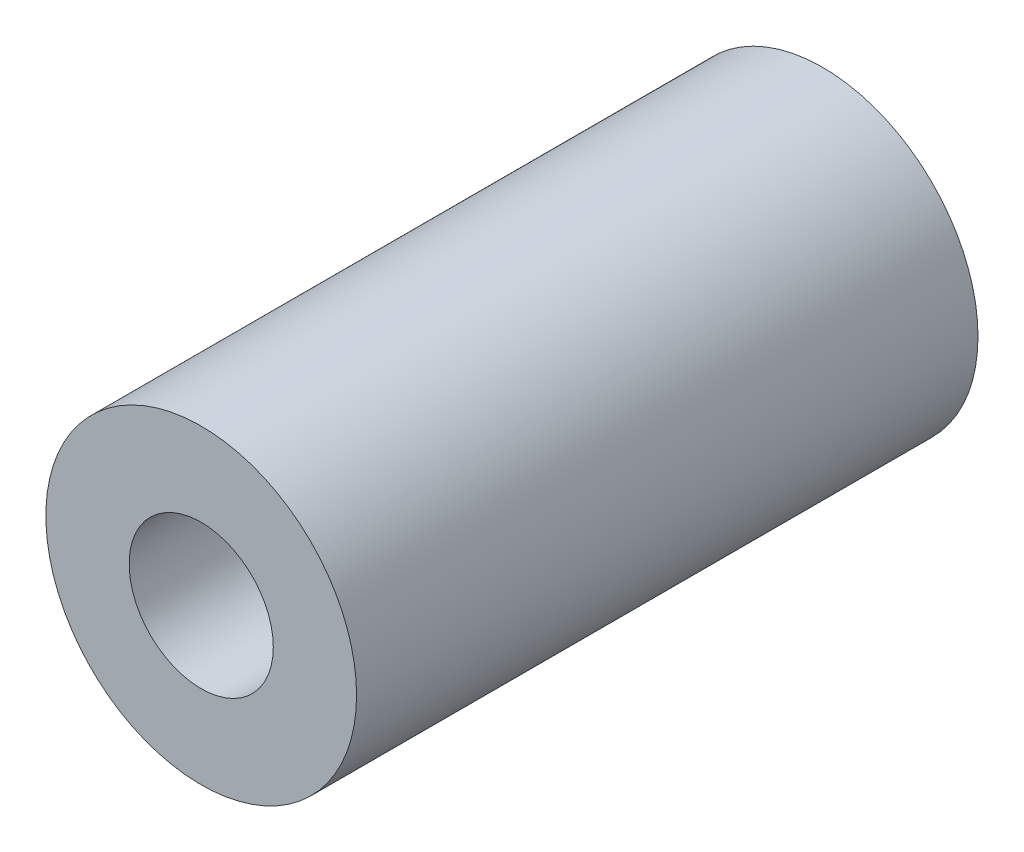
ISO-10303-21;
HEADER;
FILE_DESCRIPTION(('STEP AP214'),'2;1');
FILE_NAME('part.step','',(''),(''),'','','');
FILE_SCHEMA(('AUTOMOTIVE_DESIGN { 1 0 10303 214 1 1 1 1 }'));
ENDSEC;
DATA;
#1=APPLICATION_CONTEXT('core data for automotive mechanical design processes');
#2=APPLICATION_PROTOCOL_DEFINITION('international standard','automotive_design',2000,#1);
#3=PRODUCT_CONTEXT('',#1,'mechanical');
#4=PRODUCT('Part','Part','',(#3));
#5=PRODUCT_RELATED_PRODUCT_CATEGORY('part','',(#4));
#6=PRODUCT_DEFINITION_FORMATION('','',#4);
#7=PRODUCT_DEFINITION_CONTEXT('part definition',#1,'design');
#8=PRODUCT_DEFINITION('design','',#6,#7);
#9=PRODUCT_DEFINITION_SHAPE('','',#8);
#10=(LENGTH_UNIT() NAMED_UNIT(*) SI_UNIT(.MILLI.,.METRE.));
#11=(NAMED_UNIT(*) PLANE_ANGLE_UNIT() SI_UNIT($,.RADIAN.));
#12=(NAMED_UNIT(*) SI_UNIT($,.STERADIAN.) SOLID_ANGLE_UNIT());
#13=UNCERTAINTY_MEASURE_WITH_UNIT(LENGTH_MEASURE(1.E-05),#10,'distance_accuracy_value','');
#14=(GEOMETRIC_REPRESENTATION_CONTEXT(3) GLOBAL_UNCERTAINTY_ASSIGNED_CONTEXT((#13)) GLOBAL_UNIT_ASSIGNED_CONTEXT((#10,
#11,#12)) REPRESENTATION_CONTEXT('',''));
#15=CARTESIAN_POINT('',(0.,0.,0.));
#16=DIRECTION('',(0.,0.,1.));
#17=DIRECTION('',(1.,0.,0.));
#18=AXIS2_PLACEMENT_3D('',#15,#16,#17);
#19=CARTESIAN_POINT('',(0.,0.,12.7));
#20=DIRECTION('',(0.,0.,-1.));
#21=DIRECTION('',(-1.,0.,0.));
#22=AXIS2_PLACEMENT_3D('',#19,#20,#21);
#23=CYLINDRICAL_SURFACE('',#22,3.175);
#24=CARTESIAN_POINT('',(0.,0.,12.7));
#25=DIRECTION('',(0.,0.,1.));
#26=DIRECTION('',(1.,0.,0.));
#27=AXIS2_PLACEMENT_3D('',#24,#25,#26);
#28=CIRCLE('',#27,3.175);
#29=CARTESIAN_POINT('',(3.175,0.,12.7));
#30=VERTEX_POINT('',#29);
#31=EDGE_CURVE('E10',#30,#30,#28,.T.);
#32=ORIENTED_EDGE('',*,*,#31,.F.);
#33=EDGE_LOOP('',(#32));
#34=FACE_BOUND('',#33,.T.);
#35=CARTESIAN_POINT('',(0.,0.,0.));
#36=DIRECTION('',(0.,0.,1.));
#37=DIRECTION('',(1.,0.,0.));
#38=AXIS2_PLACEMENT_3D('',#35,#36,#37);
#39=CIRCLE('',#38,3.175);
#40=CARTESIAN_POINT('',(3.175,0.,0.));
#41=VERTEX_POINT('',#40);
#42=EDGE_CURVE('E34',#41,#41,#39,.T.);
#43=ORIENTED_EDGE('',*,*,#42,.T.);
#44=EDGE_LOOP('',(#43));
#45=FACE_BOUND('',#44,.T.);
#46=ADVANCED_FACE('F31',(#34,#45),#23,.T.);
#47=CARTESIAN_POINT('',(0.,0.,12.7));
#48=DIRECTION('',(0.,0.,1.));
#49=DIRECTION('',(1.,0.,0.));
#50=AXIS2_PLACEMENT_3D('',#47,#48,#49);
#51=PLANE('',#50);
#52=CARTESIAN_POINT('',(0.,0.,12.7));
#53=DIRECTION('',(0.,0.,1.));
#54=DIRECTION('',(1.,0.,0.));
#55=AXIS2_PLACEMENT_3D('',#52,#53,#54);
#56=CIRCLE('',#55,1.47319999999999);
#57=CARTESIAN_POINT('',(1.47319999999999,0.,12.7));
#58=VERTEX_POINT('',#57);
#59=EDGE_CURVE('E45',#58,#58,#56,.T.);
#60=ORIENTED_EDGE('',*,*,#59,.F.);
#61=EDGE_LOOP('',(#60));
#62=FACE_BOUND('',#61,.T.);
#63=ORIENTED_EDGE('',*,*,#31,.T.);
#64=EDGE_LOOP('',(#63));
#65=FACE_BOUND('',#64,.T.);
#66=ADVANCED_FACE('F51',(#62,#65),#51,.T.);
#67=CARTESIAN_POINT('',(0.,0.,0.));
#68=DIRECTION('',(0.,0.,1.));
#69=DIRECTION('',(1.,0.,0.));
#70=AXIS2_PLACEMENT_3D('',#67,#68,#69);
#71=PLANE('',#70);
#72=CARTESIAN_POINT('',(0.,0.,0.));
#73=DIRECTION('',(0.,0.,1.));
#74=DIRECTION('',(1.,0.,0.));
#75=AXIS2_PLACEMENT_3D('',#72,#73,#74);
#76=CIRCLE('',#75,1.4732);
#77=CARTESIAN_POINT('',(1.4732,0.,0.));
#78=VERTEX_POINT('',#77);
#79=EDGE_CURVE('E41',#78,#78,#76,.T.);
#80=ORIENTED_EDGE('',*,*,#79,.T.);
#81=EDGE_LOOP('',(#80));
#82=FACE_BOUND('',#81,.T.);
#83=ORIENTED_EDGE('',*,*,#42,.F.);
#84=EDGE_LOOP('',(#83));
#85=FACE_BOUND('',#84,.T.);
#86=ADVANCED_FACE('F53',(#82,#85),#71,.F.);
#87=CARTESIAN_POINT('',(0.,0.,12.7));
#88=DIRECTION('',(0.,0.,1.));
#89=DIRECTION('',(1.,0.,0.));
#90=AXIS2_PLACEMENT_3D('',#87,#88,#89);
#91=CYLINDRICAL_SURFACE('',#90,1.47319999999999);
#92=ORIENTED_EDGE('',*,*,#79,.F.);
#93=EDGE_LOOP('',(#92));
#94=FACE_BOUND('',#93,.T.);
#95=ORIENTED_EDGE('',*,*,#59,.T.);
#96=EDGE_LOOP('',(#95));
#97=FACE_BOUND('',#96,.T.);
#98=ADVANCED_FACE('F49',(#94,#97),#91,.F.);
#99=CLOSED_SHELL('',(#46,#66,#86,#98));
#100=MANIFOLD_SOLID_BREP('B2',#99);
#101=ADVANCED_BREP_SHAPE_REPRESENTATION('',(#18,#100),#14);
#102=SHAPE_DEFINITION_REPRESENTATION(#9,#101);
ENDSEC;
END-ISO-10303-21;
